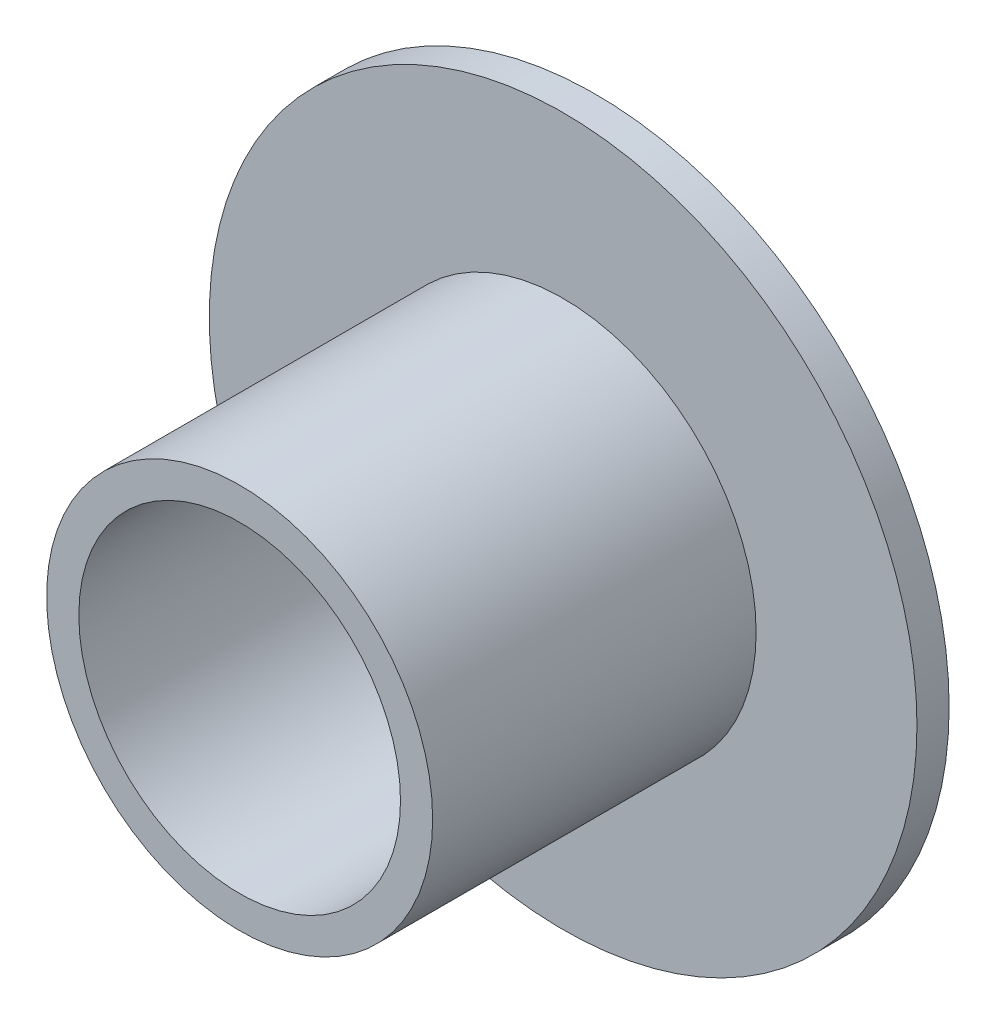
from build123d import *

# Parameters (mm, degrees)
SKETCH1_R          = 110
SKETCH1_R_2        = 50
BASE_EXTRUDE_DEPTH = 10
SKETCH2_R          = 60
SKETCH2_R_2        = 50
EXTRUDE1_DEPTH     = 100.55


with BuildPart() as part:
    # Sketch1 → Base-Extrude (new body)
    with BuildSketch(Plane.XY.offset(-10)):
        Circle(SKETCH1_R)
        Circle(SKETCH1_R_2, mode=Mode.SUBTRACT)
    extrude(amount=BASE_EXTRUDE_DEPTH)

    # Sketch2 → Extrude1 (add)
    with BuildSketch(Plane.XY):
        Circle(SKETCH2_R)
        Circle(SKETCH2_R_2, mode=Mode.SUBTRACT)
    extrude(amount=EXTRUDE1_DEPTH)


solid = part.part
